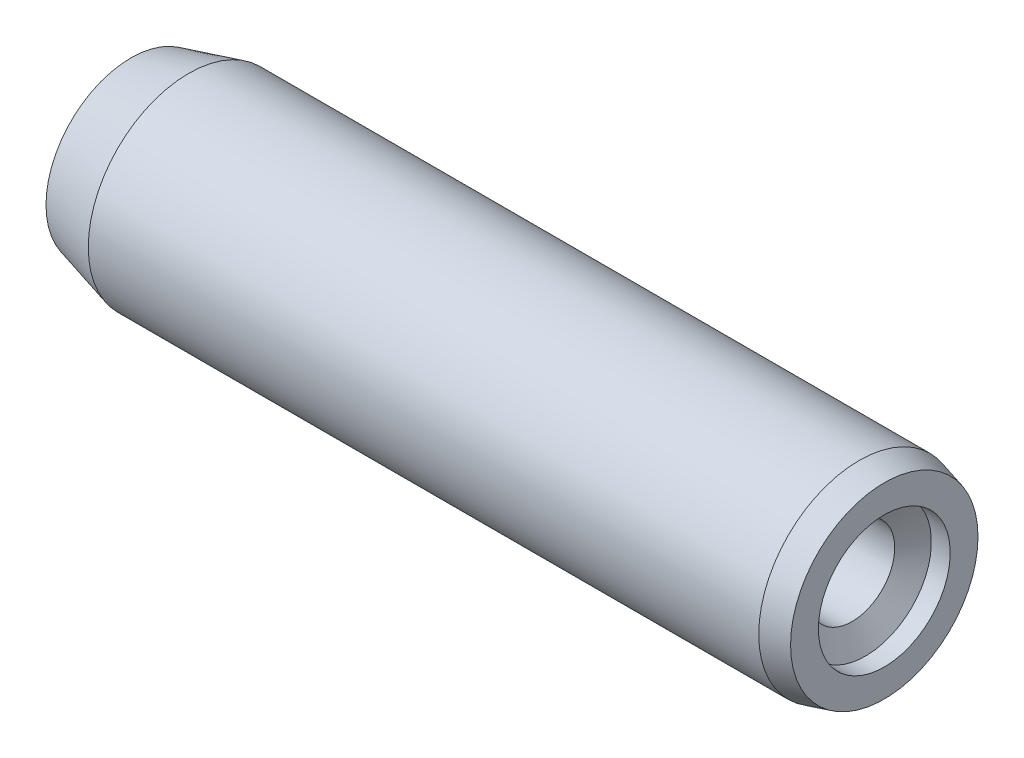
from build123d import *


with BuildPart() as part:
    # BodySke → Body (revolve)
    with BuildSketch(Plane.XY, mode=Mode.PRIVATE) as body_sk:
        Polygon((4.6, 8), (58, 8), (60, 7.464101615), (60, 5.25), (58.5, 5.25), (57.431902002, 3.4), (35, 3.4), (33.591673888, 0), (0, 0), (0, 6.767433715), align=None)
    revolve(body_sk.sketch.rotate(Axis((0, 0, 0), (1, 0, 0)), 90), axis=Axis((0, 0, 0), (1, 0, 0)))


solid = part.part
